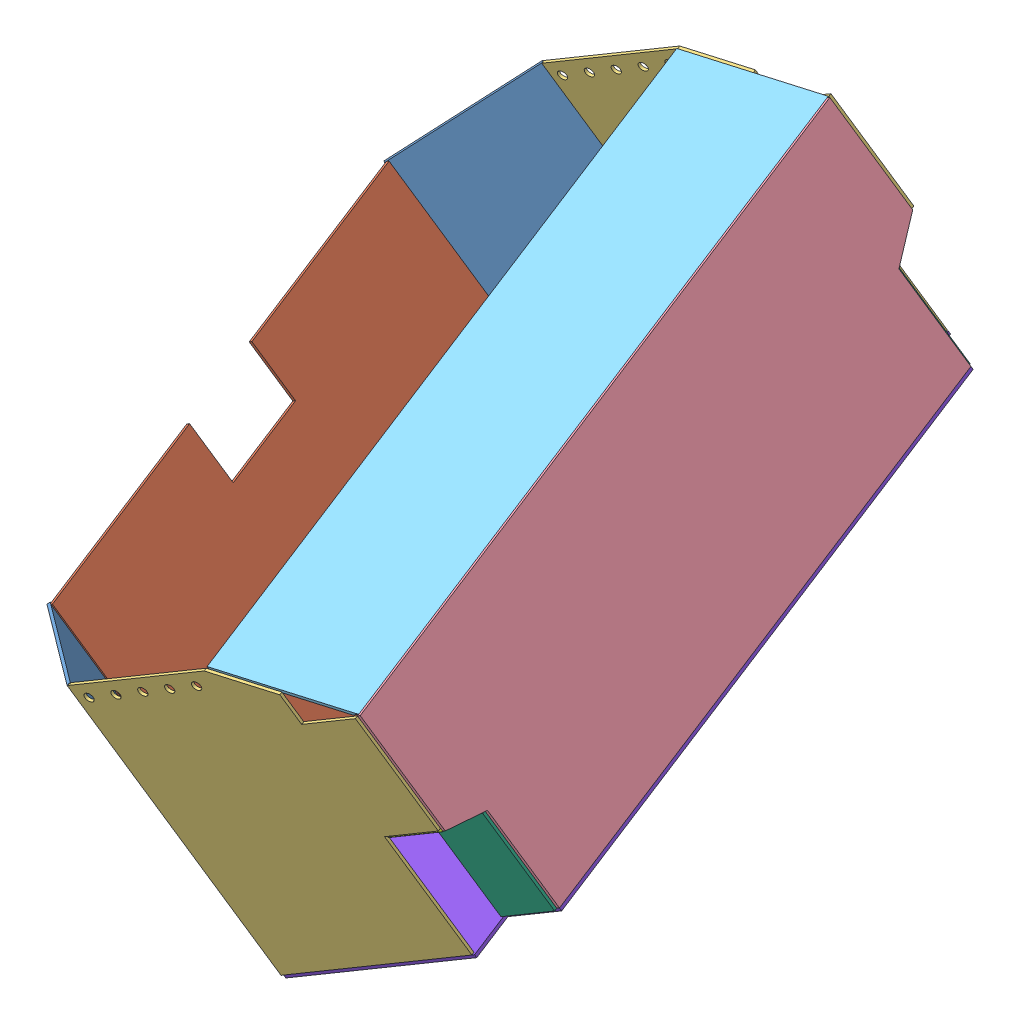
SolidWorks assembly 小箱子.SLDASM, configuration Default (file format 10000). Lengths in mm.
Overall size (194.87 199.79 253.82).
12 component instances, 8 part files, 26 mates.
Components (placement in the parent):
- 背侧面-1: 背侧面.SLDPRT [Default] at (-180.2883 493.0889 -96.3778) x (0.768501 0.167812 0.617451) z (-0.462775 -0.520632 0.717483) size (47 98 1)
- 背面-1: 背面.SLDPRT [Default] at (-221.479 525.1138 -188.2094) x (0.216181 -0.249481 0.943941) z (-0.870643 -0.486803 0.070734) size (162 98 1)
- 正侧面-1: 正侧面.SLDPRT [Default] at (-194.8516 556.0976 -298.7856) x (0.870643 0.486803 -0.070734) z (0.216181 -0.249481 0.943941) size (91 98 1)
- 背侧面-2: 背侧面.SLDPRT [Default] at (-222.2783 540.7186 -277.574) x (0.462775 0.520632 -0.717483) z (0.768501 0.167812 0.617451) size (47 98 1)
- 正侧面-2: 正侧面.SLDPRT [Default] at (-145.8218 499.3138 -83.9415) x (0.870643 0.486803 -0.070734) z (0.216181 -0.249481 0.943941) size (91 98 1)
- 正面下-4: 正面下.SLDPRT [Default] at (-89.7732 537.1191 -223.3699) x (0.216181 -0.249481 0.943941) z (-0.870643 -0.486803 0.070734) size (226 78 1)
- 上鞋面-1: 上鞋面.SLDPRT [Default] at (-121.4417 553.7423 -75.7392) x (-0.870643 -0.486803 0.070734) z (-0.216181 0.249481 -0.943941) size (40.11 20.05 226)
- 正侧面下鞋面-1: 正侧面下鞋面.SLDPRT [Default] at (-109.228 557.4238 -302.6135) x (0.870643 0.486803 -0.070734) z (0.216181 -0.249481 0.943941) size (20 33 1)
- 正侧面鞋面-1: 正侧面鞋面.SLDPRT [Default] at (-93.0895 517.5043 -102.294) x (-0.45045 0.731186 -0.51231) z (0.870643 0.486803 -0.070734) size (7 14 20)
- 正侧面下鞋面-2: 正侧面下鞋面.SLDPRT [Default] at (-66.208 507.7771 -114.7692) x (0.870643 0.486803 -0.070734) z (0.216181 -0.249481 0.943941) size (20 33 1)
- 正侧面鞋面-2: 正侧面鞋面.SLDPRT [Default] at (-136.4176 566.3982 -299.1119) x (0.353601 -0.719299 -0.597976) z (0.870643 0.486803 -0.070734) size (7 14 20)
- 底面-3: 底面.SLDPRT [Default] at (-125.7132 486.9025 -184.8781) x (-0.216181 0.249481 -0.943941) z (0.441867 -0.837127 -0.322447) size (228 124 1)
Mates (geometry in assembly coordinates):
- 平行9: parallel aligned: line of 背面-1 through (-249.0297 563.5217 -248.8562) axis (0.441867 -0.837127 -0.322447); line of 背侧面-2 through (-249.2753 563.2454 -248.4755) axis (0.441867 -0.837127 -0.322447)
- 平行12: parallel anti-aligned: line of 正侧面-1 through (-228.0437 587.2343 -281.8952) axis (0.441867 -0.837127 -0.322447); line of 背侧面-2 through (-184.2219 505.6767 -313.797) axis (-0.441867 0.837127 0.322447)
- 重合31: coincident anti-aligned: line of 背侧面-1 through (-135.7109 448.4121 -98.6509) axis (-0.441867 0.837127 0.322447); line of 正侧面-2 through (-179.0139 530.4506 -67.0511) axis (0.441867 -0.837127 -0.322447)
- 重合63: coincident aligned: line of 正侧面-2 through (-74.3732 526.4458 -93.1337) axis (-0.441867 0.837127 0.322447); line of 正面下-4 through (-73.9314 525.6086 -93.4562) axis (-0.441867 0.837127 0.322447)
- 平行25: parallel aligned: line of 正侧面-2 through (-74.3732 526.4458 -93.1337) axis (-0.441867 0.837127 0.322447); line of 正面下-4 through (-73.0607 526.0954 -93.5269) axis (-0.441867 0.837127 0.322447)
- 重合80: coincident anti-aligned: line of 正侧面-1 through (-228.2599 587.4838 -282.8391) axis (0.441867 -0.837127 -0.322447); line of 背侧面-2 through (-184.9904 505.5089 -314.4144) axis (-0.441867 0.837127 0.322447)
- 重合82: coincident aligned: line of 正面下-4 through (-140.0211 614.6393 -294.2114) axis (0.216181 -0.249481 0.943941); line of 上鞋面-1 through (-140.1434 614.7805 -294.7457) axis (0.216181 -0.249481 0.943941)
- 平行27: parallel aligned: line of 正侧面-2 through (-112.7795 556.6423 -75.2977) axis (-0.976336 -0.061035 0.207469); line of 上鞋面-1 through (-93.2333 557.3093 -81.2568) axis (-0.976336 -0.061035 0.207469)
- 重合86: coincident anti-aligned: line of 正侧面-1 through (-161.8094 613.4261 -290.1417) axis (-0.976336 -0.061035 0.207469); line of 上鞋面-1 through (-183.9242 612.0436 -285.4424) axis (0.976336 0.061035 -0.207469)
- 重合97: coincident anti-aligned: line of 正面下-4 through (-74.3067 524.0786 -108.606) axis (0.441867 -0.837127 -0.322447); line of 正侧面下鞋面-2 through (-59.7251 496.4534 -119.2468) axis (-0.441867 0.837127 0.322447)
- 重合107: coincident anti-aligned: line of 正面下-4 through (-117.1106 573.4759 -295.5064) axis (0.441867 -0.837127 -0.322447); line of 正侧面下鞋面-1 through (-102.529 545.8507 -306.1471) axis (-0.441867 0.837127 0.322447)
- 重合124: coincident aligned: line of 正侧面下鞋面-1 through (-117.1106 573.4759 -295.5064) axis (-0.870643 -0.486803 0.070734); line of 正侧面鞋面-2 through (-117.1106 573.4759 -295.5064) axis (-0.870643 -0.486803 0.070734)
- 重合125: coincident: point of 正侧面下鞋面-1; point of 正侧面鞋面-2
- 重合126: coincident aligned: line of 正侧面鞋面-1 through (-74.3067 524.0786 -108.606) axis (-0.870643 -0.486803 0.070734); line of 正侧面下鞋面-2 through (-74.3067 524.0786 -108.606) axis (-0.870643 -0.486803 0.070734)
- 重合127: coincident aligned: line of 正面下-4 through (-74.3067 524.0786 -108.606) axis (0.024642 0.100451 0.994637); line of 正侧面鞋面-1 through (-74.3067 524.0786 -108.606) axis (0.024642 0.100451 0.994637)
- 重合128: coincident aligned: line of 正面下-4 through (-101.6583 546.3375 -306.2178) axis (0.216181 -0.249481 0.943941); line of 底面-3 through (-101.6583 546.3375 -306.2178) axis (0.216181 -0.249481 0.943941)
- 重合129: coincident anti-aligned: line of 正面下-4 through (-73.4361 524.5654 -108.6768) axis (0.441867 -0.837127 -0.322447); line of 底面-3 through (-58.4126 496.1031 -119.6399) axis (-0.441867 0.837127 0.322447)
- 重合130: coincident anti-aligned: line of 背面-1 through (-205.7268 481.4832 -280.4559) axis (0.216181 -0.249481 0.943941); line of 底面-3 through (-170.7055 441.0673 -127.5375) axis (-0.216181 0.249481 -0.943941)
- 重合132: coincident anti-aligned: line of 背面-1 through (-249.0297 563.5217 -248.8562) axis (0.441867 -0.837127 -0.322447); line of 底面-3 through (-205.2849 480.6461 -280.7784) axis (-0.441867 0.837127 0.322447)
- 重合133: coincident aligned: line of 背侧面-2 through (-205.9723 481.207 -280.0752) axis (0.462775 0.520632 -0.717483); line of 底面-3 through (-205.7268 481.4832 -280.4559) axis (0.462775 0.520632 -0.717483)
- 平行29: parallel aligned: line of 正侧面-1 through (-184.9569 505.4453 -314.4389) axis (0.870643 0.486803 -0.070734); line of 底面-3 through (-184.1295 505.7806 -313.9402) axis (0.870643 0.486803 -0.070734)
- 锁定1: lock: unknown of 背面-1; unknown of 背侧面-2
- 平行32: parallel anti-aligned: line of 正侧面下鞋面-1 through (-119.9418 536.1146 -304.7324) axis (0.870643 0.486803 -0.070734); line of 正侧面鞋面-2 through (-117.1106 573.4759 -295.5064) axis (-0.870643 -0.486803 0.070734)
- 重合139: coincident anti-aligned: line of 正侧面-2 through (-135.7109 448.4121 -98.6509) axis (0.870643 0.486803 -0.070734); line of 底面-3 through (-73.0246 483.4619 -103.7437) axis (-0.870643 -0.486803 0.070734)
- 重合142: coincident anti-aligned: plane of 背侧面-1 through (-171.8304 440.5249 -127.6711) normal (0.441867 -0.837127 -0.322447); plane of 底面-3 through (-125.7132 486.9025 -184.8781) normal (-0.441867 0.837127 0.322447)
- 重合143: coincident aligned: line of 正侧面下鞋面-1 through (-119.9418 536.1146 -304.7324) axis (0.870643 0.486803 -0.070734); line of 底面-3 through (-119.0712 536.6014 -304.8032) axis (0.870643 0.486803 -0.070734)
